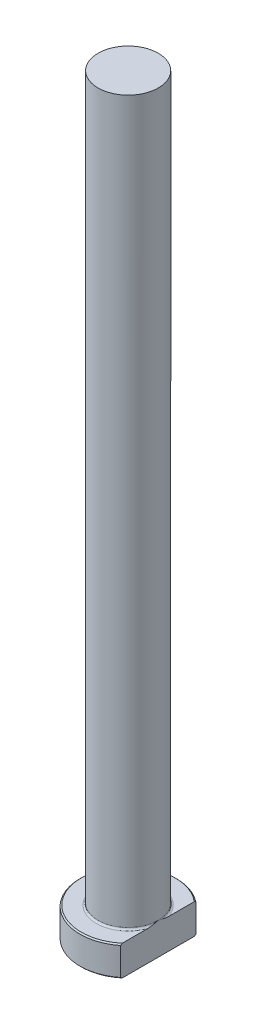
from build123d import *
from build123d.topology import SkipClean

# Parameters (mm, degrees)
CHAMFER1_SIZE = 0.2
FILLET1_R     = 0.3
KEY_DEPTH     = 126.510955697


with BuildPart() as part:
    # Sketch1 → Revolve1 (revolve)
    with BuildSketch(Plane.XY, mode=Mode.PRIVATE) as revolve1_sk:
        Polygon((0, 0), (-8, 0), (-8, 5), (-5, 5), (-5, 125), (0, 125), align=None)
    revolve(revolve1_sk.sketch.rotate(Axis((0, 259.958771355, 0), (0, -1, 0)), 270), axis=Axis((0, 259.958771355, 0), (0, -1, 0)))

    # Chamfer1
    chamfer1_edges = [part.edges().sort_by_distance(p)[0] for p in [
        (0, 5, -8),
        (0, 0, -8),
    ]]
    chamfer(chamfer1_edges, length=CHAMFER1_SIZE)

    # Fillet1
    fillet1_edges = [part.edges().sort_by_distance(p)[0] for p in [
        (0, 5, -5),
    ]]
    fillet(fillet1_edges, radius=FILLET1_R)

    # Sketch2 → KEY (cut, through all)
    with SkipClean():  # the faces are left unmerged after this step: merging them gives an invalid solid
        with BuildSketch(Plane(origin=(0, 0, 0), x_dir=(1, 0, 0), z_dir=(0, 1, 0))):
            with BuildLine():
                Line((5, 6.244997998), (5, -6.244997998))
                ThreePointArc((5, -6.244997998), (8, 0), (5, 6.244997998))
            make_face()
        extrude(amount=KEY_DEPTH, mode=Mode.SUBTRACT)


solid = part.part
